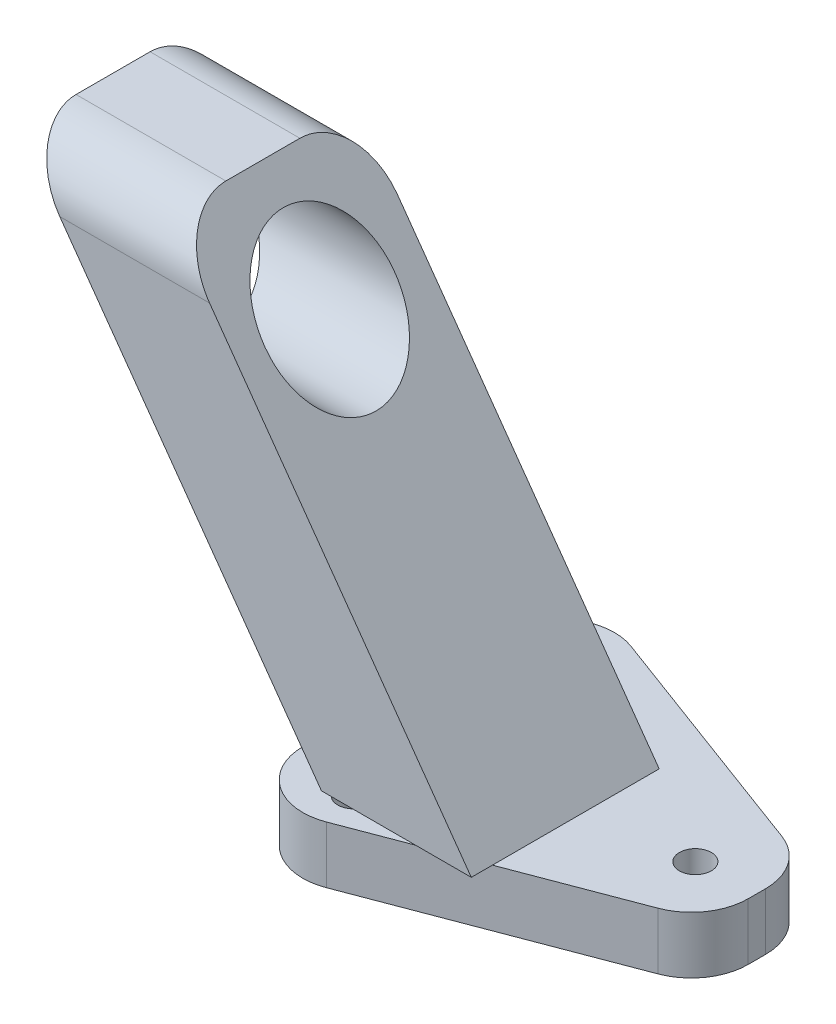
from build123d import *

# Parameters (mm, degrees)
SKETCH_1_R          = 1.396147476
SKETCH_1_R_2        = 1.39638514
SKETCH_1_R_3        = 1.401251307
EXTRUDE_1_DEPTH     = 5
EXTRUDE_2_DEPTH     = 16.5
SKETCH_4_R          = 5.7
CUT_EXTRUDE_2_DEPTH = 179
SKETCH_5_W          = 19.604564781
SKETCH_5_H          = 22.059068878
CUT_EXTRUDE_3_DEPTH = 0.1
FILLET_2_R          = 5


with BuildPart() as part:
    # Sketch 1 → Extrude 1 (new body)
    with BuildSketch(Plane(origin=(0, 0, 0), x_dir=(1, 0, 0), z_dir=(0, 1, 0))):
        with BuildLine():
            Line((-6.913119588, 24.594474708), (14.200013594, 16.754747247))
            ThreePointArc((14.200013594, 16.754747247), (16.564551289, 14.922062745), (17.459528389, 12.067454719))
            Line((17.459528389, 12.067454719), (17.459528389, 10.534017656))
            ThreePointArc((17.459528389, 10.534017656), (16.57422423, 7.693370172), (14.231817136, 5.858657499))
            Line((14.231817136, 5.858657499), (-6.881316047, -2.144697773))
            ThreePointArc((-6.881316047, -2.144697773), (-11.494252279, -1.584033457), (-13.653604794, 2.530662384))
            Line((-13.653604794, 2.530662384), (-13.653604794, 19.90718218))
            ThreePointArc((-13.653604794, 19.90718218), (-11.508212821, 24.01220508), (-6.913119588, 24.594474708))
        make_face()
        with Locations(Location((-7.680025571, 21.03147398, 0), (0, 0, 270))):
            Circle(SKETCH_1_R, mode=Mode.SUBTRACT)
        with Locations(Location((-7.680025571, 1.03147398, 0), (0, 0, 270))):
            Circle(SKETCH_1_R_2, mode=Mode.SUBTRACT)
        with Locations(Location((12.319974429, 11.03147398, 0), (0, 0, 270))):
            Circle(SKETCH_1_R_3, mode=Mode.SUBTRACT)
    extrude(amount=EXTRUDE_1_DEPTH)

    # Sketch 2 → Extrude 2 (add)
    with BuildSketch(Plane.XY):
        Polygon((3.675250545, 5), (-22.946935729, 42.280379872), (-36.101458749, 42.280379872), (-9.479272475, 5), align=None)
    extrude(amount=-EXTRUDE_2_DEPTH)

    # Sketch 4 → Cut-Extrude 2 (cut)
    with BuildSketch(Plane(origin=(130.329360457, 15.938317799, 2.845947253), x_dir=(0, -1, 0), z_dir=(1, 0, 0))):
        with Locations((-17.89030339, 11)):
            Circle(SKETCH_4_R)
    extrude(amount=-CUT_EXTRUDE_2_DEPTH, mode=Mode.SUBTRACT)

    # Sketch 5 → Cut-Extrude 3 (cut)
    with BuildSketch(Plane(origin=(0, 42.280379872, 0), x_dir=(1, 0, 0), z_dir=(0, 1, 0))):
        with Locations((-29.045946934, 8.575620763)):
            Rectangle(SKETCH_5_W, SKETCH_5_H)
    extrude(amount=-CUT_EXTRUDE_3_DEPTH, mode=Mode.SUBTRACT)

    # Fillet 2
    fillet_2_edges = [part.edges().sort_by_distance(p)[0] for p in [
        (-29.452786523, 42.180379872, 0),
        (-29.452786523, 42.180379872, -16.5),
    ]]
    fillet(fillet_2_edges, radius=FILLET_2_R)


solid = part.part
